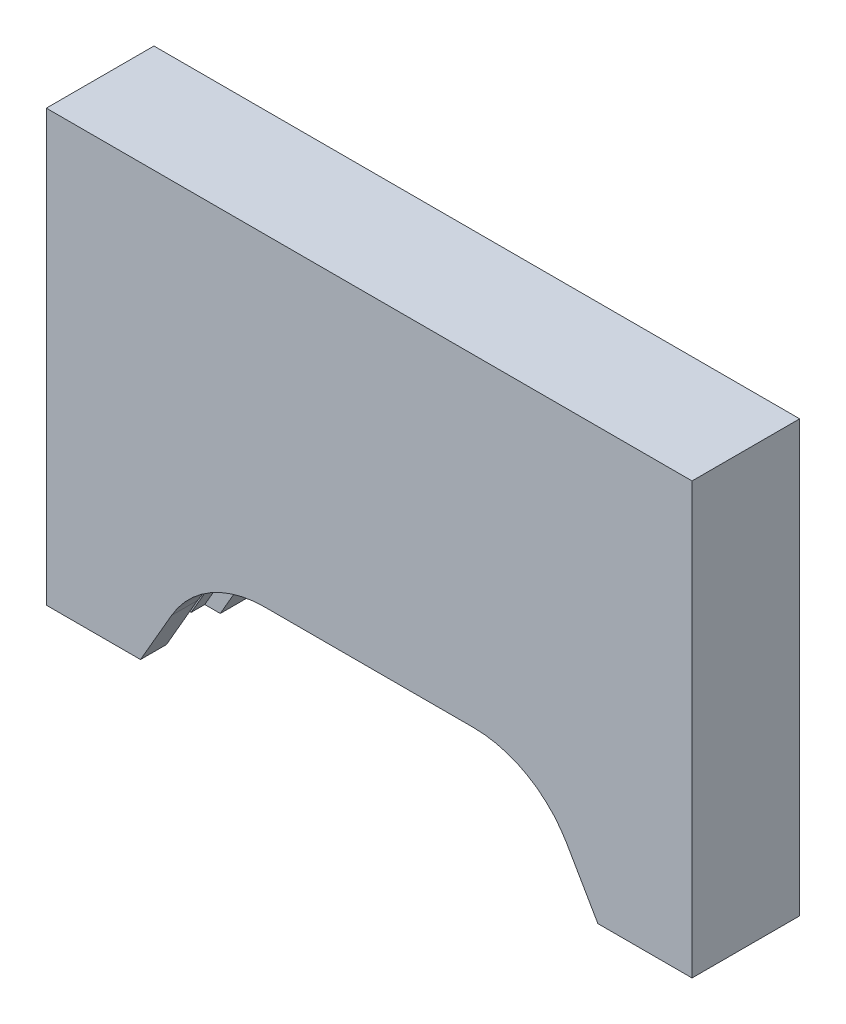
from build123d import *

# Parameters (mm, degrees)
SKETCH1_W               = 152.4
SKETCH1_H               = 101.6
BOSS_EXTRUDE1_DEPTH     = 25.4
CUT_EXTRUDE1_DEPTH      = 96.038097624
CUT_EXTRUDE1_DEPTH_BACK = 96.038097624


with BuildPart() as part:
    # Sketch1 → Boss-Extrude1 (new body)
    with BuildSketch(Plane.XY):
        Rectangle(SKETCH1_W, SKETCH1_H)
    extrude(amount=BOSS_EXTRUDE1_DEPTH)

    # Sketch3 → Cut-Extrude1 (cut, two sides: drawn at the far end of the back side and taken through both)
    with BuildSketch(Plane.XY.offset(25.4).offset(-CUT_EXTRUDE1_DEPTH_BACK)):
        with BuildLine():
            Line((-224.105526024, -345.474714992), (-53.975, -50.8))
            Line((-53.975, -50.8), (-46.642651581, -38.1))
            ThreePointArc((-46.642651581, -38.1), (-37.345606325, -28.802954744), (-24.645606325, -25.4))
            Line((-24.645606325, -25.4), (24.645606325, -25.4))
            ThreePointArc((24.645606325, -25.4), (37.345606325, -28.802954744), (46.642651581, -38.1))
            Line((46.642651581, -38.1), (53.975, -50.8))
            Line((53.975, -50.8), (224.105526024, -345.474714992))
            Line((224.105526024, -345.474714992), (224.105526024, -1025.996819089))
            Line((224.105526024, -1025.996819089), (-224.105526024, -1025.996819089))
            Line((-224.105526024, -1025.996819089), (-224.105526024, -345.474714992))
        make_face()
    extrude(amount=CUT_EXTRUDE1_DEPTH + CUT_EXTRUDE1_DEPTH_BACK, mode=Mode.SUBTRACT)

    # Cut-Sweep2: sweep along a path in Sketch6
    with BuildLine(Plane.XY.offset(12.7)) as cut_sweep2_path:
        Line((64.973522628, -63.5), (49.392282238, -36.5125))
        ThreePointArc((49.392282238, -36.5125), (38.933106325, -26.053324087), (24.645606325, -22.225))
        Line((24.645606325, -22.225), (-24.645606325, -22.225))
        ThreePointArc((-24.645606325, -22.225), (-38.933106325, -26.053324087), (-49.392282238, -36.5125))
        Line((-49.392282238, -36.5125), (-64.973522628, -63.5))
    # Sketch9 → Cut-Sweep2 (sweep, cut)
    with BuildSketch(Plane(origin=(-64.973522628, -63.5, 12.7), x_dir=(0.86602540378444, -0.4999999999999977, 0), z_dir=(0.4999999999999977, 0.86602540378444, 0))):
        with BuildLine():
            Line((0, -3.39564548), (0, -6.57064548))
            Line((0, -6.57064548), (6.35, -6.57064548))
            Line((6.35, -6.57064548), (6.35, 6.12935452))
            Line((6.35, 6.12935452), (0, 6.12935452))
            Line((0, 6.12935452), (0, 2.95435452))
            ThreePointArc((0, 2.95435452), (-3.175, -0.22064548), (0, -3.39564548))
        make_face()
    sweep(path=cut_sweep2_path.line, mode=Mode.SUBTRACT)


solid = part.part
